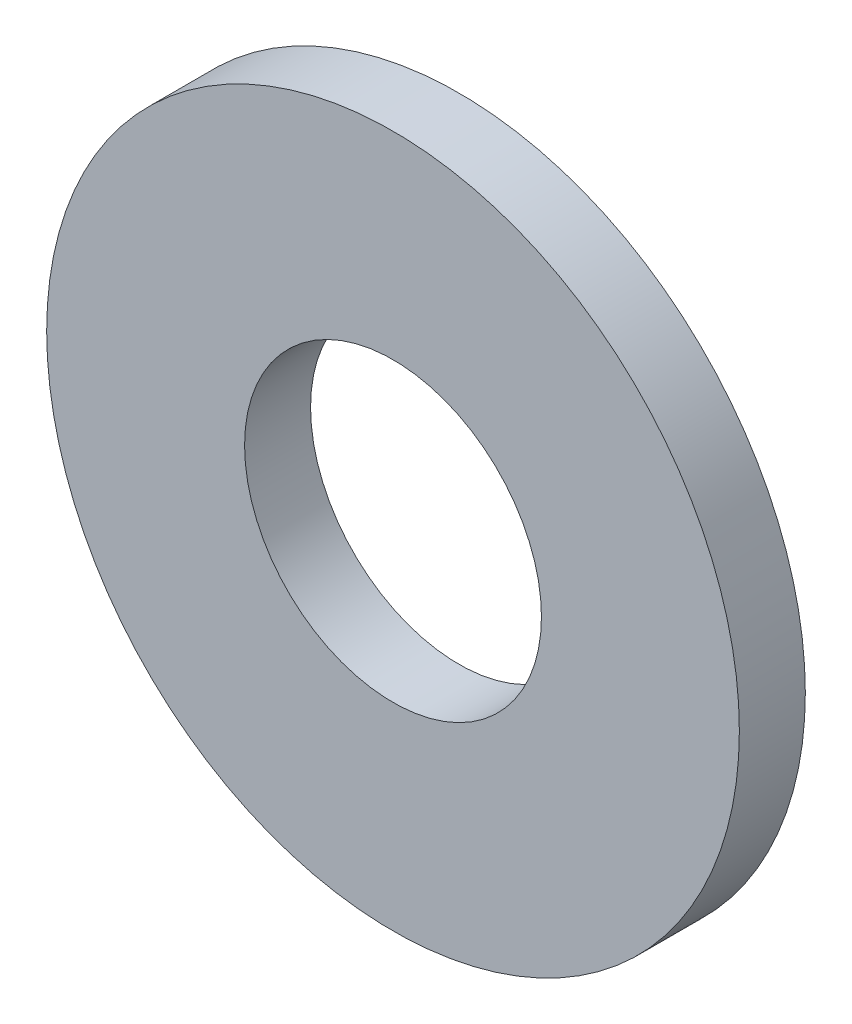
ISO-10303-21;
HEADER;
FILE_DESCRIPTION(('STEP AP214'),'2;1');
FILE_NAME('part.step','',(''),(''),'','','');
FILE_SCHEMA(('AUTOMOTIVE_DESIGN { 1 0 10303 214 1 1 1 1 }'));
ENDSEC;
DATA;
#1=APPLICATION_CONTEXT('core data for automotive mechanical design processes');
#2=APPLICATION_PROTOCOL_DEFINITION('international standard','automotive_design',2000,#1);
#3=PRODUCT_CONTEXT('',#1,'mechanical');
#4=PRODUCT('Part','Part','',(#3));
#5=PRODUCT_RELATED_PRODUCT_CATEGORY('part','',(#4));
#6=PRODUCT_DEFINITION_FORMATION('','',#4);
#7=PRODUCT_DEFINITION_CONTEXT('part definition',#1,'design');
#8=PRODUCT_DEFINITION('design','',#6,#7);
#9=PRODUCT_DEFINITION_SHAPE('','',#8);
#10=(LENGTH_UNIT() NAMED_UNIT(*) SI_UNIT(.MILLI.,.METRE.));
#11=(NAMED_UNIT(*) PLANE_ANGLE_UNIT() SI_UNIT($,.RADIAN.));
#12=(NAMED_UNIT(*) SI_UNIT($,.STERADIAN.) SOLID_ANGLE_UNIT());
#13=UNCERTAINTY_MEASURE_WITH_UNIT(LENGTH_MEASURE(1.E-05),#10,'distance_accuracy_value','');
#14=(GEOMETRIC_REPRESENTATION_CONTEXT(3) GLOBAL_UNCERTAINTY_ASSIGNED_CONTEXT((#13)) GLOBAL_UNIT_ASSIGNED_CONTEXT((#10,
#11,#12)) REPRESENTATION_CONTEXT('',''));
#15=CARTESIAN_POINT('',(0.,0.,0.));
#16=DIRECTION('',(0.,0.,1.));
#17=DIRECTION('',(1.,0.,0.));
#18=AXIS2_PLACEMENT_3D('',#15,#16,#17);
#19=CARTESIAN_POINT('',(0.,-1.38777878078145E-13,-6.00000000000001));
#20=DIRECTION('',(0.,0.,1.));
#21=DIRECTION('',(1.,0.,0.));
#22=AXIS2_PLACEMENT_3D('',#19,#20,#21);
#23=CYLINDRICAL_SURFACE('',#22,31.5);
#24=CARTESIAN_POINT('',(0.,-1.38777878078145E-13,-6.00000000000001));
#25=DIRECTION('',(0.,0.,1.));
#26=DIRECTION('',(1.,0.,0.));
#27=AXIS2_PLACEMENT_3D('',#24,#25,#26);
#28=CIRCLE('',#27,31.5);
#29=CARTESIAN_POINT('',(31.5000000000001,-1.36289451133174E-13,-6.00000000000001));
#30=VERTEX_POINT('',#29);
#31=EDGE_CURVE('E10',#30,#30,#28,.T.);
#32=ORIENTED_EDGE('',*,*,#31,.T.);
#33=EDGE_LOOP('',(#32));
#34=FACE_BOUND('',#33,.T.);
#35=CARTESIAN_POINT('',(0.,0.,0.));
#36=DIRECTION('',(0.,0.,1.));
#37=DIRECTION('',(1.,0.,0.));
#38=AXIS2_PLACEMENT_3D('',#35,#36,#37);
#39=CIRCLE('',#38,31.5);
#40=CARTESIAN_POINT('',(31.5000000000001,0.,0.));
#41=VERTEX_POINT('',#40);
#42=EDGE_CURVE('E28',#41,#41,#39,.T.);
#43=ORIENTED_EDGE('',*,*,#42,.F.);
#44=EDGE_LOOP('',(#43));
#45=FACE_BOUND('',#44,.T.);
#46=ADVANCED_FACE('F22',(#34,#45),#23,.T.);
#47=CARTESIAN_POINT('',(0.,-1.38777878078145E-13,-6.00000000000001));
#48=DIRECTION('',(0.,0.,1.));
#49=DIRECTION('',(1.,0.,0.));
#50=AXIS2_PLACEMENT_3D('',#47,#48,#49);
#51=PLANE('',#50);
#52=CARTESIAN_POINT('',(0.,-1.38777878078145E-13,-6.00000000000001));
#53=DIRECTION('',(0.,0.,1.));
#54=DIRECTION('',(1.,0.,0.));
#55=AXIS2_PLACEMENT_3D('',#52,#53,#54);
#56=CIRCLE('',#55,13.5);
#57=CARTESIAN_POINT('',(13.5,-1.37711409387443E-13,-6.00000000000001));
#58=VERTEX_POINT('',#57);
#59=EDGE_CURVE('E32',#58,#58,#56,.T.);
#60=ORIENTED_EDGE('',*,*,#59,.T.);
#61=EDGE_LOOP('',(#60));
#62=FACE_BOUND('',#61,.T.);
#63=ORIENTED_EDGE('',*,*,#31,.F.);
#64=EDGE_LOOP('',(#63));
#65=FACE_BOUND('',#64,.T.);
#66=ADVANCED_FACE('F46',(#62,#65),#51,.F.);
#67=CARTESIAN_POINT('',(0.,0.,0.));
#68=DIRECTION('',(0.,0.,1.));
#69=DIRECTION('',(1.,0.,0.));
#70=AXIS2_PLACEMENT_3D('',#67,#68,#69);
#71=PLANE('',#70);
#72=CARTESIAN_POINT('',(0.,0.,0.));
#73=DIRECTION('',(0.,0.,1.));
#74=DIRECTION('',(1.,0.,0.));
#75=AXIS2_PLACEMENT_3D('',#72,#73,#74);
#76=CIRCLE('',#75,13.5);
#77=CARTESIAN_POINT('',(13.5,0.,0.));
#78=VERTEX_POINT('',#77);
#79=EDGE_CURVE('E36',#78,#78,#76,.T.);
#80=ORIENTED_EDGE('',*,*,#79,.F.);
#81=EDGE_LOOP('',(#80));
#82=FACE_BOUND('',#81,.T.);
#83=ORIENTED_EDGE('',*,*,#42,.T.);
#84=EDGE_LOOP('',(#83));
#85=FACE_BOUND('',#84,.T.);
#86=ADVANCED_FACE('F44',(#82,#85),#71,.T.);
#87=CARTESIAN_POINT('',(0.,-1.38777878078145E-13,-6.00000000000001));
#88=DIRECTION('',(0.,0.,1.));
#89=DIRECTION('',(1.,0.,0.));
#90=AXIS2_PLACEMENT_3D('',#87,#88,#89);
#91=CYLINDRICAL_SURFACE('',#90,13.5);
#92=ORIENTED_EDGE('',*,*,#59,.F.);
#93=EDGE_LOOP('',(#92));
#94=FACE_BOUND('',#93,.T.);
#95=ORIENTED_EDGE('',*,*,#79,.T.);
#96=EDGE_LOOP('',(#95));
#97=FACE_BOUND('',#96,.T.);
#98=ADVANCED_FACE('F42',(#94,#97),#91,.F.);
#99=CLOSED_SHELL('',(#46,#66,#86,#98));
#100=MANIFOLD_SOLID_BREP('B2',#99);
#101=ADVANCED_BREP_SHAPE_REPRESENTATION('',(#18,#100),#14);
#102=SHAPE_DEFINITION_REPRESENTATION(#9,#101);
ENDSEC;
END-ISO-10303-21;
